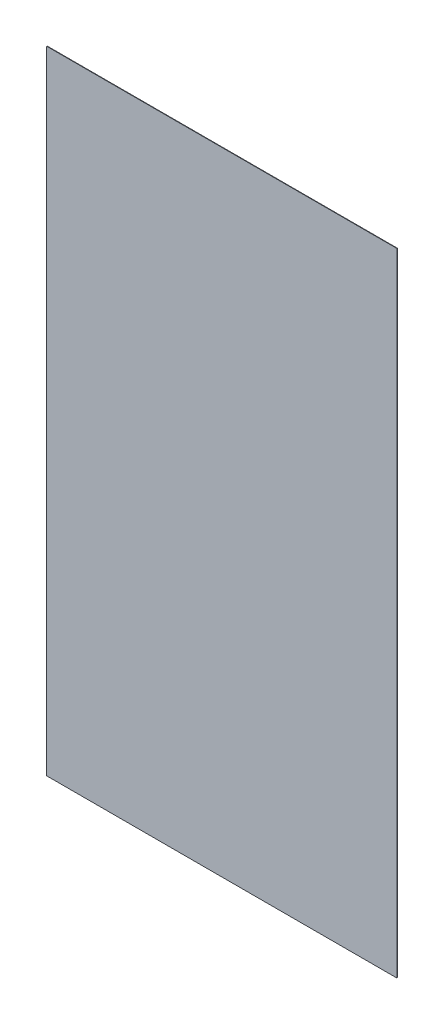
ISO-10303-21;
HEADER;
FILE_DESCRIPTION(('STEP AP214'),'2;1');
FILE_NAME('part.step','',(''),(''),'','','');
FILE_SCHEMA(('AUTOMOTIVE_DESIGN { 1 0 10303 214 1 1 1 1 }'));
ENDSEC;
DATA;
#1=APPLICATION_CONTEXT('core data for automotive mechanical design processes');
#2=APPLICATION_PROTOCOL_DEFINITION('international standard','automotive_design',2000,#1);
#3=PRODUCT_CONTEXT('',#1,'mechanical');
#4=PRODUCT('Part','Part','',(#3));
#5=PRODUCT_RELATED_PRODUCT_CATEGORY('part','',(#4));
#6=PRODUCT_DEFINITION_FORMATION('','',#4);
#7=PRODUCT_DEFINITION_CONTEXT('part definition',#1,'design');
#8=PRODUCT_DEFINITION('design','',#6,#7);
#9=PRODUCT_DEFINITION_SHAPE('','',#8);
#10=(LENGTH_UNIT() NAMED_UNIT(*) SI_UNIT(.MILLI.,.METRE.));
#11=(NAMED_UNIT(*) PLANE_ANGLE_UNIT() SI_UNIT($,.RADIAN.));
#12=(NAMED_UNIT(*) SI_UNIT($,.STERADIAN.) SOLID_ANGLE_UNIT());
#13=UNCERTAINTY_MEASURE_WITH_UNIT(LENGTH_MEASURE(1.E-05),#10,'distance_accuracy_value','');
#14=(GEOMETRIC_REPRESENTATION_CONTEXT(3) GLOBAL_UNCERTAINTY_ASSIGNED_CONTEXT((#13)) GLOBAL_UNIT_ASSIGNED_CONTEXT((#10,
#11,#12)) REPRESENTATION_CONTEXT('',''));
#15=CARTESIAN_POINT('',(0.,0.,0.));
#16=DIRECTION('',(0.,0.,1.));
#17=DIRECTION('',(1.,0.,0.));
#18=AXIS2_PLACEMENT_3D('',#15,#16,#17);
#19=CARTESIAN_POINT('',(3.80999999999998,13.7539999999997,0.01));
#20=DIRECTION('',(-1.,0.,0.));
#21=DIRECTION('',(0.,0.,1.));
#22=AXIS2_PLACEMENT_3D('',#19,#20,#21);
#23=PLANE('',#22);
#24=DIRECTION('',(0.,1.,0.));
#25=VECTOR('',#24,1.);
#26=CARTESIAN_POINT('',(3.80999999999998,13.7539999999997,0.));
#27=LINE('',#26,#25);
#28=CARTESIAN_POINT('',(3.80999999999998,0.,0.));
#29=VERTEX_POINT('',#28);
#30=CARTESIAN_POINT('',(3.80999999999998,13.7539999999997,0.));
#31=VERTEX_POINT('',#30);
#32=EDGE_CURVE('E106',#29,#31,#27,.T.);
#33=ORIENTED_EDGE('',*,*,#32,.T.);
#34=DIRECTION('',(0.,0.,-1.));
#35=VECTOR('',#34,1.);
#36=CARTESIAN_POINT('',(3.80999999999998,13.7539999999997,0.01));
#37=LINE('',#36,#35);
#38=CARTESIAN_POINT('',(3.80999999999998,13.7539999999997,0.01));
#39=VERTEX_POINT('',#38);
#40=EDGE_CURVE('E11',#39,#31,#37,.T.);
#41=ORIENTED_EDGE('',*,*,#40,.F.);
#42=DIRECTION('',(0.,1.,0.));
#43=VECTOR('',#42,1.);
#44=CARTESIAN_POINT('',(3.80999999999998,13.7539999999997,0.01));
#45=LINE('',#44,#43);
#46=CARTESIAN_POINT('',(3.80999999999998,0.,0.01));
#47=VERTEX_POINT('',#46);
#48=EDGE_CURVE('E88',#47,#39,#45,.T.);
#49=ORIENTED_EDGE('',*,*,#48,.F.);
#50=DIRECTION('',(0.,0.,-1.));
#51=VECTOR('',#50,1.);
#52=CARTESIAN_POINT('',(3.80999999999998,0.,0.01));
#53=LINE('',#52,#51);
#54=EDGE_CURVE('E102',#47,#29,#53,.T.);
#55=ORIENTED_EDGE('',*,*,#54,.T.);
#56=EDGE_LOOP('',(#33,#41,#49,#55));
#57=FACE_BOUND('',#56,.T.);
#58=ADVANCED_FACE('F36',(#57),#23,.F.);
#59=CARTESIAN_POINT('',(-3.80999999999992,13.7539999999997,0.01));
#60=DIRECTION('',(0.,-1.,0.));
#61=DIRECTION('',(0.,0.,-1.));
#62=AXIS2_PLACEMENT_3D('',#59,#60,#61);
#63=PLANE('',#62);
#64=DIRECTION('',(-1.,0.,0.));
#65=VECTOR('',#64,1.);
#66=CARTESIAN_POINT('',(-3.80999999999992,13.7539999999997,0.));
#67=LINE('',#66,#65);
#68=CARTESIAN_POINT('',(-3.80999999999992,13.7539999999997,0.));
#69=VERTEX_POINT('',#68);
#70=EDGE_CURVE('E93',#31,#69,#67,.T.);
#71=ORIENTED_EDGE('',*,*,#70,.T.);
#72=DIRECTION('',(0.,0.,-1.));
#73=VECTOR('',#72,1.);
#74=CARTESIAN_POINT('',(-3.80999999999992,13.7539999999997,0.01));
#75=LINE('',#74,#73);
#76=CARTESIAN_POINT('',(-3.80999999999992,13.7539999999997,0.01));
#77=VERTEX_POINT('',#76);
#78=EDGE_CURVE('E45',#77,#69,#75,.T.);
#79=ORIENTED_EDGE('',*,*,#78,.F.);
#80=DIRECTION('',(-1.,0.,0.));
#81=VECTOR('',#80,1.);
#82=CARTESIAN_POINT('',(-3.80999999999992,13.7539999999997,0.01));
#83=LINE('',#82,#81);
#84=EDGE_CURVE('E83',#39,#77,#83,.T.);
#85=ORIENTED_EDGE('',*,*,#84,.F.);
#86=ORIENTED_EDGE('',*,*,#40,.T.);
#87=EDGE_LOOP('',(#71,#79,#85,#86));
#88=FACE_BOUND('',#87,.T.);
#89=ADVANCED_FACE('F92',(#88),#63,.F.);
#90=CARTESIAN_POINT('',(-3.80999999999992,0.,0.01));
#91=DIRECTION('',(1.,0.,0.));
#92=DIRECTION('',(0.,0.,-1.));
#93=AXIS2_PLACEMENT_3D('',#90,#91,#92);
#94=PLANE('',#93);
#95=DIRECTION('',(0.,-1.,0.));
#96=VECTOR('',#95,1.);
#97=CARTESIAN_POINT('',(-3.80999999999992,0.,0.));
#98=LINE('',#97,#96);
#99=CARTESIAN_POINT('',(-3.80999999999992,0.,0.));
#100=VERTEX_POINT('',#99);
#101=EDGE_CURVE('E70',#69,#100,#98,.T.);
#102=ORIENTED_EDGE('',*,*,#101,.T.);
#103=DIRECTION('',(0.,0.,-1.));
#104=VECTOR('',#103,1.);
#105=CARTESIAN_POINT('',(-3.80999999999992,0.,0.01));
#106=LINE('',#105,#104);
#107=CARTESIAN_POINT('',(-3.80999999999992,0.,0.01));
#108=VERTEX_POINT('',#107);
#109=EDGE_CURVE('E95',#108,#100,#106,.T.);
#110=ORIENTED_EDGE('',*,*,#109,.F.);
#111=DIRECTION('',(0.,-1.,0.));
#112=VECTOR('',#111,1.);
#113=CARTESIAN_POINT('',(-3.80999999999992,0.,0.01));
#114=LINE('',#113,#112);
#115=EDGE_CURVE('E86',#77,#108,#114,.T.);
#116=ORIENTED_EDGE('',*,*,#115,.F.);
#117=ORIENTED_EDGE('',*,*,#78,.T.);
#118=EDGE_LOOP('',(#102,#110,#116,#117));
#119=FACE_BOUND('',#118,.T.);
#120=ADVANCED_FACE('F96',(#119),#94,.F.);
#121=CARTESIAN_POINT('',(3.80999999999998,0.,0.01));
#122=DIRECTION('',(0.,1.,0.));
#123=DIRECTION('',(0.,0.,1.));
#124=AXIS2_PLACEMENT_3D('',#121,#122,#123);
#125=PLANE('',#124);
#126=DIRECTION('',(1.,0.,0.));
#127=VECTOR('',#126,1.);
#128=CARTESIAN_POINT('',(3.80999999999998,0.,0.));
#129=LINE('',#128,#127);
#130=EDGE_CURVE('E76',#100,#29,#129,.T.);
#131=ORIENTED_EDGE('',*,*,#130,.T.);
#132=ORIENTED_EDGE('',*,*,#54,.F.);
#133=DIRECTION('',(1.,0.,0.));
#134=VECTOR('',#133,1.);
#135=CARTESIAN_POINT('',(3.80999999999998,0.,0.01));
#136=LINE('',#135,#134);
#137=EDGE_CURVE('E53',#108,#47,#136,.T.);
#138=ORIENTED_EDGE('',*,*,#137,.F.);
#139=ORIENTED_EDGE('',*,*,#109,.T.);
#140=EDGE_LOOP('',(#131,#132,#138,#139));
#141=FACE_BOUND('',#140,.T.);
#142=ADVANCED_FACE('F117',(#141),#125,.F.);
#143=CARTESIAN_POINT('',(0.,0.,0.01));
#144=DIRECTION('',(0.,0.,-1.));
#145=DIRECTION('',(-1.,0.,0.));
#146=AXIS2_PLACEMENT_3D('',#143,#144,#145);
#147=PLANE('',#146);
#148=ORIENTED_EDGE('',*,*,#48,.T.);
#149=ORIENTED_EDGE('',*,*,#84,.T.);
#150=ORIENTED_EDGE('',*,*,#115,.T.);
#151=ORIENTED_EDGE('',*,*,#137,.T.);
#152=EDGE_LOOP('',(#148,#149,#150,#151));
#153=FACE_BOUND('',#152,.T.);
#154=ADVANCED_FACE('F84',(#153),#147,.F.);
#155=CARTESIAN_POINT('',(0.,0.,0.));
#156=DIRECTION('',(0.,0.,-1.));
#157=DIRECTION('',(-1.,0.,0.));
#158=AXIS2_PLACEMENT_3D('',#155,#156,#157);
#159=PLANE('',#158);
#160=ORIENTED_EDGE('',*,*,#32,.F.);
#161=ORIENTED_EDGE('',*,*,#130,.F.);
#162=ORIENTED_EDGE('',*,*,#101,.F.);
#163=ORIENTED_EDGE('',*,*,#70,.F.);
#164=EDGE_LOOP('',(#160,#161,#162,#163));
#165=FACE_BOUND('',#164,.T.);
#166=ADVANCED_FACE('F120',(#165),#159,.T.);
#167=CLOSED_SHELL('',(#58,#89,#120,#142,#154,#166));
#168=MANIFOLD_SOLID_BREP('B2',#167);
#169=ADVANCED_BREP_SHAPE_REPRESENTATION('',(#18,#168),#14);
#170=SHAPE_DEFINITION_REPRESENTATION(#9,#169);
ENDSEC;
END-ISO-10303-21;
